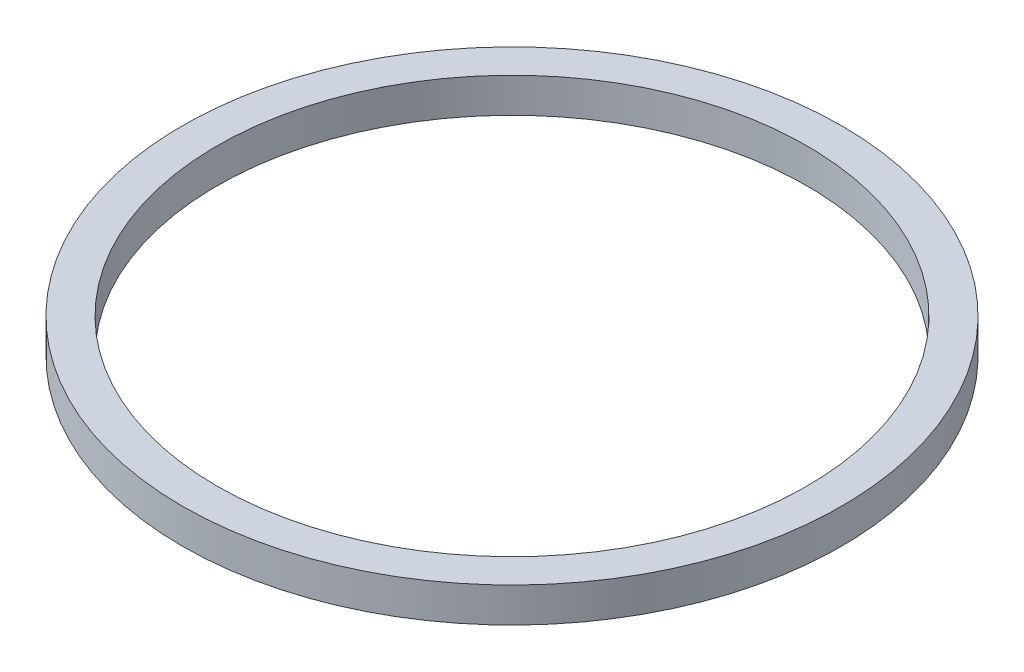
ISO-10303-21;
HEADER;
FILE_DESCRIPTION(('STEP AP214'),'2;1');
FILE_NAME('part.step','',(''),(''),'','','');
FILE_SCHEMA(('AUTOMOTIVE_DESIGN { 1 0 10303 214 1 1 1 1 }'));
ENDSEC;
DATA;
#1=APPLICATION_CONTEXT('core data for automotive mechanical design processes');
#2=APPLICATION_PROTOCOL_DEFINITION('international standard','automotive_design',2000,#1);
#3=PRODUCT_CONTEXT('',#1,'mechanical');
#4=PRODUCT('Part','Part','',(#3));
#5=PRODUCT_RELATED_PRODUCT_CATEGORY('part','',(#4));
#6=PRODUCT_DEFINITION_FORMATION('','',#4);
#7=PRODUCT_DEFINITION_CONTEXT('part definition',#1,'design');
#8=PRODUCT_DEFINITION('design','',#6,#7);
#9=PRODUCT_DEFINITION_SHAPE('','',#8);
#10=(LENGTH_UNIT() NAMED_UNIT(*) SI_UNIT(.MILLI.,.METRE.));
#11=(NAMED_UNIT(*) PLANE_ANGLE_UNIT() SI_UNIT($,.RADIAN.));
#12=(NAMED_UNIT(*) SI_UNIT($,.STERADIAN.) SOLID_ANGLE_UNIT());
#13=UNCERTAINTY_MEASURE_WITH_UNIT(LENGTH_MEASURE(1.E-05),#10,'distance_accuracy_value','');
#14=(GEOMETRIC_REPRESENTATION_CONTEXT(3) GLOBAL_UNCERTAINTY_ASSIGNED_CONTEXT((#13)) GLOBAL_UNIT_ASSIGNED_CONTEXT((#10,
#11,#12)) REPRESENTATION_CONTEXT('',''));
#15=CARTESIAN_POINT('',(0.,0.,0.));
#16=DIRECTION('',(0.,0.,1.));
#17=DIRECTION('',(1.,0.,0.));
#18=AXIS2_PLACEMENT_3D('',#15,#16,#17);
#19=CARTESIAN_POINT('',(0.,6.35,0.));
#20=DIRECTION('',(0.,1.,0.));
#21=DIRECTION('',(0.,0.,1.));
#22=AXIS2_PLACEMENT_3D('',#19,#20,#21);
#23=PLANE('',#22);
#24=CARTESIAN_POINT('',(0.,6.35,0.));
#25=DIRECTION('',(0.,1.,0.));
#26=DIRECTION('',(0.,0.,1.));
#27=AXIS2_PLACEMENT_3D('',#24,#25,#26);
#28=CIRCLE('',#27,60.325);
#29=CARTESIAN_POINT('',(0.,6.35,60.325));
#30=VERTEX_POINT('',#29);
#31=EDGE_CURVE('E10',#30,#30,#28,.T.);
#32=ORIENTED_EDGE('',*,*,#31,.T.);
#33=EDGE_LOOP('',(#32));
#34=FACE_BOUND('',#33,.T.);
#35=CARTESIAN_POINT('',(0.,6.35,0.));
#36=DIRECTION('',(0.,1.,0.));
#37=DIRECTION('',(0.,0.,1.));
#38=AXIS2_PLACEMENT_3D('',#35,#36,#37);
#39=CIRCLE('',#38,53.975);
#40=CARTESIAN_POINT('',(0.,6.35,53.975));
#41=VERTEX_POINT('',#40);
#42=EDGE_CURVE('E43',#41,#41,#39,.T.);
#43=ORIENTED_EDGE('',*,*,#42,.F.);
#44=EDGE_LOOP('',(#43));
#45=FACE_BOUND('',#44,.T.);
#46=ADVANCED_FACE('F32',(#34,#45),#23,.T.);
#47=CARTESIAN_POINT('',(0.,0.,0.));
#48=DIRECTION('',(0.,1.,0.));
#49=DIRECTION('',(0.,0.,1.));
#50=AXIS2_PLACEMENT_3D('',#47,#48,#49);
#51=PLANE('',#50);
#52=CARTESIAN_POINT('',(0.,0.,0.));
#53=DIRECTION('',(0.,1.,0.));
#54=DIRECTION('',(0.,0.,1.));
#55=AXIS2_PLACEMENT_3D('',#52,#53,#54);
#56=CIRCLE('',#55,60.325);
#57=CARTESIAN_POINT('',(0.,0.,60.325));
#58=VERTEX_POINT('',#57);
#59=EDGE_CURVE('E36',#58,#58,#56,.T.);
#60=ORIENTED_EDGE('',*,*,#59,.F.);
#61=EDGE_LOOP('',(#60));
#62=FACE_BOUND('',#61,.T.);
#63=CARTESIAN_POINT('',(0.,0.,0.));
#64=DIRECTION('',(0.,1.,0.));
#65=DIRECTION('',(0.,0.,1.));
#66=AXIS2_PLACEMENT_3D('',#63,#64,#65);
#67=CIRCLE('',#66,53.975);
#68=CARTESIAN_POINT('',(0.,0.,53.975));
#69=VERTEX_POINT('',#68);
#70=EDGE_CURVE('E45',#69,#69,#67,.T.);
#71=ORIENTED_EDGE('',*,*,#70,.T.);
#72=EDGE_LOOP('',(#71));
#73=FACE_BOUND('',#72,.T.);
#74=ADVANCED_FACE('F55',(#62,#73),#51,.F.);
#75=CARTESIAN_POINT('',(0.,6.35,0.));
#76=DIRECTION('',(0.,-1.,0.));
#77=DIRECTION('',(0.,0.,-1.));
#78=AXIS2_PLACEMENT_3D('',#75,#76,#77);
#79=CYLINDRICAL_SURFACE('',#78,60.325);
#80=ORIENTED_EDGE('',*,*,#31,.F.);
#81=EDGE_LOOP('',(#80));
#82=FACE_BOUND('',#81,.T.);
#83=ORIENTED_EDGE('',*,*,#59,.T.);
#84=EDGE_LOOP('',(#83));
#85=FACE_BOUND('',#84,.T.);
#86=ADVANCED_FACE('F34',(#82,#85),#79,.T.);
#87=CARTESIAN_POINT('',(0.,6.35,0.));
#88=DIRECTION('',(0.,-1.,0.));
#89=DIRECTION('',(0.,0.,-1.));
#90=AXIS2_PLACEMENT_3D('',#87,#88,#89);
#91=CYLINDRICAL_SURFACE('',#90,53.975);
#92=ORIENTED_EDGE('',*,*,#42,.T.);
#93=EDGE_LOOP('',(#92));
#94=FACE_BOUND('',#93,.T.);
#95=ORIENTED_EDGE('',*,*,#70,.F.);
#96=EDGE_LOOP('',(#95));
#97=FACE_BOUND('',#96,.T.);
#98=ADVANCED_FACE('F51',(#94,#97),#91,.F.);
#99=CLOSED_SHELL('',(#46,#74,#86,#98));
#100=MANIFOLD_SOLID_BREP('B2',#99);
#101=ADVANCED_BREP_SHAPE_REPRESENTATION('',(#18,#100),#14);
#102=SHAPE_DEFINITION_REPRESENTATION(#9,#101);
ENDSEC;
END-ISO-10303-21;
